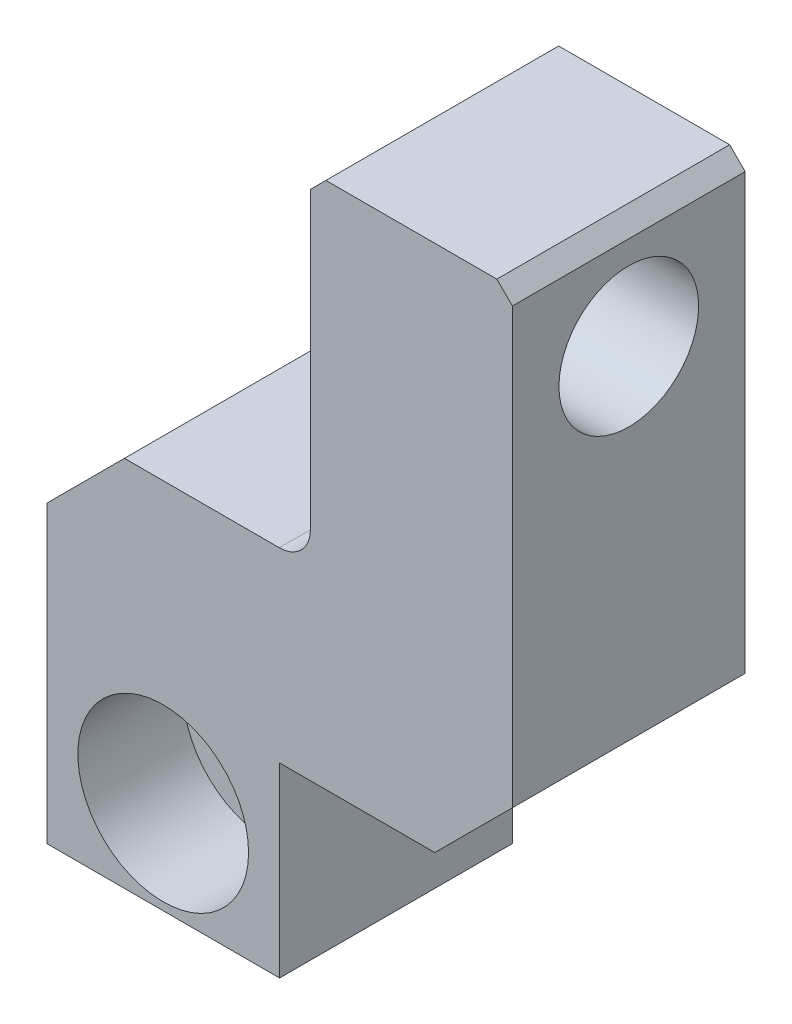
ISO-10303-21;
HEADER;
FILE_DESCRIPTION(('STEP AP214'),'2;1');
FILE_NAME('part.step','',(''),(''),'','','');
FILE_SCHEMA(('AUTOMOTIVE_DESIGN { 1 0 10303 214 1 1 1 1 }'));
ENDSEC;
DATA;
#1=APPLICATION_CONTEXT('core data for automotive mechanical design processes');
#2=APPLICATION_PROTOCOL_DEFINITION('international standard','automotive_design',2000,#1);
#3=PRODUCT_CONTEXT('',#1,'mechanical');
#4=PRODUCT('Part','Part','',(#3));
#5=PRODUCT_RELATED_PRODUCT_CATEGORY('part','',(#4));
#6=PRODUCT_DEFINITION_FORMATION('','',#4);
#7=PRODUCT_DEFINITION_CONTEXT('part definition',#1,'design');
#8=PRODUCT_DEFINITION('design','',#6,#7);
#9=PRODUCT_DEFINITION_SHAPE('','',#8);
#10=(LENGTH_UNIT() NAMED_UNIT(*) SI_UNIT(.MILLI.,.METRE.));
#11=(NAMED_UNIT(*) PLANE_ANGLE_UNIT() SI_UNIT($,.RADIAN.));
#12=(NAMED_UNIT(*) SI_UNIT($,.STERADIAN.) SOLID_ANGLE_UNIT());
#13=UNCERTAINTY_MEASURE_WITH_UNIT(LENGTH_MEASURE(1.E-05),#10,'distance_accuracy_value','');
#14=(GEOMETRIC_REPRESENTATION_CONTEXT(3) GLOBAL_UNCERTAINTY_ASSIGNED_CONTEXT((#13)) GLOBAL_UNIT_ASSIGNED_CONTEXT((#10,
#11,#12)) REPRESENTATION_CONTEXT('',''));
#15=CARTESIAN_POINT('',(0.,0.,0.));
#16=DIRECTION('',(0.,0.,1.));
#17=DIRECTION('',(1.,0.,0.));
#18=AXIS2_PLACEMENT_3D('',#15,#16,#17);
#19=CARTESIAN_POINT('',(153.4992259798,34.,15.));
#20=DIRECTION('',(-1.,0.,0.));
#21=DIRECTION('',(0.,0.,1.));
#22=AXIS2_PLACEMENT_3D('',#19,#20,#21);
#23=PLANE('',#22);
#24=CARTESIAN_POINT('',(153.4992259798,27.,7.5));
#25=DIRECTION('',(-1.,0.,0.));
#26=DIRECTION('',(0.,0.,1.));
#27=AXIS2_PLACEMENT_3D('',#24,#25,#26);
#28=CIRCLE('',#27,4.5);
#29=CARTESIAN_POINT('',(153.4992259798,27.,12.));
#30=VERTEX_POINT('',#29);
#31=EDGE_CURVE('E292',#30,#30,#28,.T.);
#32=ORIENTED_EDGE('',*,*,#31,.T.);
#33=EDGE_LOOP('',(#32));
#34=FACE_BOUND('',#33,.T.);
#35=DIRECTION('',(0.,1.,0.));
#36=VECTOR('',#35,1.);
#37=CARTESIAN_POINT('',(153.4992259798,34.,0.));
#38=LINE('',#37,#36);
#39=CARTESIAN_POINT('',(153.4992259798,5.,0.));
#40=VERTEX_POINT('',#39);
#41=CARTESIAN_POINT('',(153.4992259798,33.,0.));
#42=VERTEX_POINT('',#41);
#43=EDGE_CURVE('E148',#40,#42,#38,.T.);
#44=ORIENTED_EDGE('',*,*,#43,.T.);
#45=DIRECTION('',(0.,0.,1.));
#46=VECTOR('',#45,1.);
#47=CARTESIAN_POINT('',(153.4992259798,33.,15.));
#48=LINE('',#47,#46);
#49=CARTESIAN_POINT('',(153.4992259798,33.,15.));
#50=VERTEX_POINT('',#49);
#51=EDGE_CURVE('E39',#42,#50,#48,.T.);
#52=ORIENTED_EDGE('',*,*,#51,.T.);
#53=DIRECTION('',(0.,1.,0.));
#54=VECTOR('',#53,1.);
#55=CARTESIAN_POINT('',(153.4992259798,34.,15.));
#56=LINE('',#55,#54);
#57=CARTESIAN_POINT('',(153.4992259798,5.,15.));
#58=VERTEX_POINT('',#57);
#59=EDGE_CURVE('E167',#58,#50,#56,.T.);
#60=ORIENTED_EDGE('',*,*,#59,.F.);
#61=DIRECTION('',(0.,0.,-1.));
#62=VECTOR('',#61,1.);
#63=CARTESIAN_POINT('',(153.4992259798,5.,15.));
#64=LINE('',#63,#62);
#65=EDGE_CURVE('E181',#58,#40,#64,.T.);
#66=ORIENTED_EDGE('',*,*,#65,.T.);
#67=EDGE_LOOP('',(#44,#52,#60,#66));
#68=FACE_BOUND('',#67,.T.);
#69=ADVANCED_FACE('F16',(#34,#68),#23,.F.);
#70=CARTESIAN_POINT('',(140.481760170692,34.,15.));
#71=DIRECTION('',(0.,-1.,0.));
#72=DIRECTION('',(0.,0.,-1.));
#73=AXIS2_PLACEMENT_3D('',#70,#71,#72);
#74=PLANE('',#73);
#75=DIRECTION('',(-1.,0.,0.));
#76=VECTOR('',#75,1.);
#77=CARTESIAN_POINT('',(140.481760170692,34.,15.));
#78=LINE('',#77,#76);
#79=CARTESIAN_POINT('',(152.4992259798,34.,15.));
#80=VERTEX_POINT('',#79);
#81=CARTESIAN_POINT('',(141.481760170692,34.,15.));
#82=VERTEX_POINT('',#81);
#83=EDGE_CURVE('E209',#80,#82,#78,.T.);
#84=ORIENTED_EDGE('',*,*,#83,.F.);
#85=DIRECTION('',(0.,0.,-1.));
#86=VECTOR('',#85,1.);
#87=CARTESIAN_POINT('',(152.4992259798,34.,15.));
#88=LINE('',#87,#86);
#89=CARTESIAN_POINT('',(152.4992259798,34.,0.));
#90=VERTEX_POINT('',#89);
#91=EDGE_CURVE('E199',#80,#90,#88,.T.);
#92=ORIENTED_EDGE('',*,*,#91,.T.);
#93=DIRECTION('',(-1.,0.,0.));
#94=VECTOR('',#93,1.);
#95=CARTESIAN_POINT('',(140.481760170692,34.,0.));
#96=LINE('',#95,#94);
#97=CARTESIAN_POINT('',(141.481760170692,34.,0.));
#98=VERTEX_POINT('',#97);
#99=EDGE_CURVE('E150',#90,#98,#96,.T.);
#100=ORIENTED_EDGE('',*,*,#99,.T.);
#101=DIRECTION('',(0.,0.,1.));
#102=VECTOR('',#101,1.);
#103=CARTESIAN_POINT('',(141.481760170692,34.,15.));
#104=LINE('',#103,#102);
#105=EDGE_CURVE('E197',#98,#82,#104,.T.);
#106=ORIENTED_EDGE('',*,*,#105,.T.);
#107=EDGE_LOOP('',(#84,#92,#100,#106));
#108=FACE_BOUND('',#107,.T.);
#109=ADVANCED_FACE('F213',(#108),#74,.F.);
#110=CARTESIAN_POINT('',(140.481760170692,34.,15.));
#111=DIRECTION('',(1.,0.,0.));
#112=DIRECTION('',(0.,0.,-1.));
#113=AXIS2_PLACEMENT_3D('',#110,#111,#112);
#114=PLANE('',#113);
#115=CARTESIAN_POINT('',(140.481760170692,27.,7.5));
#116=DIRECTION('',(-1.,0.,0.));
#117=DIRECTION('',(0.,0.,1.));
#118=AXIS2_PLACEMENT_3D('',#115,#116,#117);
#119=CIRCLE('',#118,4.5);
#120=CARTESIAN_POINT('',(140.481760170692,27.,12.));
#121=VERTEX_POINT('',#120);
#122=EDGE_CURVE('E294',#121,#121,#119,.T.);
#123=ORIENTED_EDGE('',*,*,#122,.F.);
#124=EDGE_LOOP('',(#123));
#125=FACE_BOUND('',#124,.T.);
#126=DIRECTION('',(0.,-1.,0.));
#127=VECTOR('',#126,1.);
#128=CARTESIAN_POINT('',(140.481760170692,34.,15.));
#129=LINE('',#128,#127);
#130=CARTESIAN_POINT('',(140.481760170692,33.,15.));
#131=VERTEX_POINT('',#130);
#132=CARTESIAN_POINT('',(140.481760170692,14.,15.));
#133=VERTEX_POINT('',#132);
#134=EDGE_CURVE('E216',#131,#133,#129,.T.);
#135=ORIENTED_EDGE('',*,*,#134,.F.);
#136=DIRECTION('',(0.,0.,-1.));
#137=VECTOR('',#136,1.);
#138=CARTESIAN_POINT('',(140.481760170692,33.,15.));
#139=LINE('',#138,#137);
#140=CARTESIAN_POINT('',(140.481760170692,33.,0.));
#141=VERTEX_POINT('',#140);
#142=EDGE_CURVE('E11',#131,#141,#139,.T.);
#143=ORIENTED_EDGE('',*,*,#142,.T.);
#144=DIRECTION('',(0.,-1.,0.));
#145=VECTOR('',#144,1.);
#146=CARTESIAN_POINT('',(140.481760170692,34.,0.));
#147=LINE('',#146,#145);
#148=CARTESIAN_POINT('',(140.481760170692,14.,0.));
#149=VERTEX_POINT('',#148);
#150=EDGE_CURVE('E154',#141,#149,#147,.T.);
#151=ORIENTED_EDGE('',*,*,#150,.T.);
#152=DIRECTION('',(0.,0.,-1.));
#153=VECTOR('',#152,1.);
#154=CARTESIAN_POINT('',(140.481760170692,14.,15.));
#155=LINE('',#154,#153);
#156=EDGE_CURVE('E173',#149,#133,#155,.F.);
#157=ORIENTED_EDGE('',*,*,#156,.T.);
#158=EDGE_LOOP('',(#135,#143,#151,#157));
#159=FACE_BOUND('',#158,.T.);
#160=ADVANCED_FACE('F260',(#125,#159),#114,.F.);
#161=CARTESIAN_POINT('',(123.4992259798,12.,15.));
#162=DIRECTION('',(0.,-1.,0.));
#163=DIRECTION('',(0.,0.,-1.));
#164=AXIS2_PLACEMENT_3D('',#161,#162,#163);
#165=PLANE('',#164);
#166=DIRECTION('',(-1.,0.,0.));
#167=VECTOR('',#166,1.);
#168=CARTESIAN_POINT('',(123.4992259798,12.,0.));
#169=LINE('',#168,#167);
#170=CARTESIAN_POINT('',(138.481760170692,12.,0.));
#171=VERTEX_POINT('',#170);
#172=CARTESIAN_POINT('',(128.4992259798,12.,0.));
#173=VERTEX_POINT('',#172);
#174=EDGE_CURVE('E156',#171,#173,#169,.T.);
#175=ORIENTED_EDGE('',*,*,#174,.T.);
#176=DIRECTION('',(0.,0.,1.));
#177=VECTOR('',#176,1.);
#178=CARTESIAN_POINT('',(128.4992259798,12.,15.));
#179=LINE('',#178,#177);
#180=CARTESIAN_POINT('',(128.4992259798,12.,15.));
#181=VERTEX_POINT('',#180);
#182=EDGE_CURVE('E195',#173,#181,#179,.T.);
#183=ORIENTED_EDGE('',*,*,#182,.T.);
#184=DIRECTION('',(-1.,0.,0.));
#185=VECTOR('',#184,1.);
#186=CARTESIAN_POINT('',(123.4992259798,12.,15.));
#187=LINE('',#186,#185);
#188=CARTESIAN_POINT('',(138.481760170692,12.,15.));
#189=VERTEX_POINT('',#188);
#190=EDGE_CURVE('E124',#189,#181,#187,.T.);
#191=ORIENTED_EDGE('',*,*,#190,.F.);
#192=DIRECTION('',(0.,0.,-1.));
#193=VECTOR('',#192,1.);
#194=CARTESIAN_POINT('',(138.481760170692,12.,0.));
#195=LINE('',#194,#193);
#196=EDGE_CURVE('E133',#189,#171,#195,.T.);
#197=ORIENTED_EDGE('',*,*,#196,.T.);
#198=EDGE_LOOP('',(#175,#183,#191,#197));
#199=FACE_BOUND('',#198,.T.);
#200=ADVANCED_FACE('F239',(#199),#165,.F.);
#201=CARTESIAN_POINT('',(123.4992259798,-12.,15.));
#202=DIRECTION('',(1.,0.,0.));
#203=DIRECTION('',(0.,0.,-1.));
#204=AXIS2_PLACEMENT_3D('',#201,#202,#203);
#205=PLANE('',#204);
#206=DIRECTION('',(0.,-1.,0.));
#207=VECTOR('',#206,1.);
#208=CARTESIAN_POINT('',(123.4992259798,-12.,15.));
#209=LINE('',#208,#207);
#210=CARTESIAN_POINT('',(123.4992259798,7.,15.));
#211=VERTEX_POINT('',#210);
#212=CARTESIAN_POINT('',(123.4992259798,-12.,15.));
#213=VERTEX_POINT('',#212);
#214=EDGE_CURVE('E112',#211,#213,#209,.T.);
#215=ORIENTED_EDGE('',*,*,#214,.F.);
#216=DIRECTION('',(0.,0.,-1.));
#217=VECTOR('',#216,1.);
#218=CARTESIAN_POINT('',(123.4992259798,7.,15.));
#219=LINE('',#218,#217);
#220=CARTESIAN_POINT('',(123.4992259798,7.,0.));
#221=VERTEX_POINT('',#220);
#222=EDGE_CURVE('E193',#211,#221,#219,.T.);
#223=ORIENTED_EDGE('',*,*,#222,.T.);
#224=DIRECTION('',(0.,-1.,0.));
#225=VECTOR('',#224,1.);
#226=CARTESIAN_POINT('',(123.4992259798,-12.,0.));
#227=LINE('',#226,#225);
#228=CARTESIAN_POINT('',(123.4992259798,-12.,0.));
#229=VERTEX_POINT('',#228);
#230=EDGE_CURVE('E130',#221,#229,#227,.T.);
#231=ORIENTED_EDGE('',*,*,#230,.T.);
#232=DIRECTION('',(0.,0.,-1.));
#233=VECTOR('',#232,1.);
#234=CARTESIAN_POINT('',(123.4992259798,-12.,15.));
#235=LINE('',#234,#233);
#236=EDGE_CURVE('E127',#213,#229,#235,.T.);
#237=ORIENTED_EDGE('',*,*,#236,.F.);
#238=EDGE_LOOP('',(#215,#223,#231,#237));
#239=FACE_BOUND('',#238,.T.);
#240=ADVANCED_FACE('F128',(#239),#205,.F.);
#241=CARTESIAN_POINT('',(138.4992259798,-12.,15.));
#242=DIRECTION('',(0.,1.,0.));
#243=DIRECTION('',(-1.,0.,0.));
#244=AXIS2_PLACEMENT_3D('',#241,#242,#243);
#245=PLANE('',#244);
#246=DIRECTION('',(1.,0.,0.));
#247=VECTOR('',#246,1.);
#248=CARTESIAN_POINT('',(138.4992259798,-12.,0.));
#249=LINE('',#248,#247);
#250=CARTESIAN_POINT('',(138.4992259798,-12.,0.));
#251=VERTEX_POINT('',#250);
#252=EDGE_CURVE('E160',#229,#251,#249,.T.);
#253=ORIENTED_EDGE('',*,*,#252,.T.);
#254=DIRECTION('',(0.,0.,-1.));
#255=VECTOR('',#254,1.);
#256=CARTESIAN_POINT('',(138.4992259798,-12.,15.));
#257=LINE('',#256,#255);
#258=CARTESIAN_POINT('',(138.4992259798,-12.,15.));
#259=VERTEX_POINT('',#258);
#260=EDGE_CURVE('E134',#259,#251,#257,.T.);
#261=ORIENTED_EDGE('',*,*,#260,.F.);
#262=DIRECTION('',(1.,0.,0.));
#263=VECTOR('',#262,1.);
#264=CARTESIAN_POINT('',(138.4992259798,-12.,15.));
#265=LINE('',#264,#263);
#266=EDGE_CURVE('E116',#213,#259,#265,.T.);
#267=ORIENTED_EDGE('',*,*,#266,.F.);
#268=ORIENTED_EDGE('',*,*,#236,.T.);
#269=EDGE_LOOP('',(#253,#261,#267,#268));
#270=FACE_BOUND('',#269,.T.);
#271=ADVANCED_FACE('F136',(#270),#245,.F.);
#272=CARTESIAN_POINT('',(138.4992259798,-12.,15.));
#273=DIRECTION('',(-1.,0.,0.));
#274=DIRECTION('',(0.,0.,1.));
#275=AXIS2_PLACEMENT_3D('',#272,#273,#274);
#276=PLANE('',#275);
#277=DIRECTION('',(0.,1.,0.));
#278=VECTOR('',#277,1.);
#279=CARTESIAN_POINT('',(138.4992259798,-12.,0.));
#280=LINE('',#279,#278);
#281=CARTESIAN_POINT('',(138.4992259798,0.,0.));
#282=VERTEX_POINT('',#281);
#283=EDGE_CURVE('E162',#251,#282,#280,.T.);
#284=ORIENTED_EDGE('',*,*,#283,.T.);
#285=DIRECTION('',(0.,0.,-1.));
#286=VECTOR('',#285,1.);
#287=CARTESIAN_POINT('',(138.4992259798,0.,15.));
#288=LINE('',#287,#286);
#289=CARTESIAN_POINT('',(138.4992259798,0.,15.));
#290=VERTEX_POINT('',#289);
#291=EDGE_CURVE('E147',#290,#282,#288,.T.);
#292=ORIENTED_EDGE('',*,*,#291,.F.);
#293=DIRECTION('',(0.,1.,0.));
#294=VECTOR('',#293,1.);
#295=CARTESIAN_POINT('',(138.4992259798,-12.,15.));
#296=LINE('',#295,#294);
#297=EDGE_CURVE('E139',#259,#290,#296,.T.);
#298=ORIENTED_EDGE('',*,*,#297,.F.);
#299=ORIENTED_EDGE('',*,*,#260,.T.);
#300=EDGE_LOOP('',(#284,#292,#298,#299));
#301=FACE_BOUND('',#300,.T.);
#302=ADVANCED_FACE('F234',(#301),#276,.F.);
#303=CARTESIAN_POINT('',(138.4992259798,0.,15.));
#304=DIRECTION('',(0.,1.,0.));
#305=DIRECTION('',(0.,0.,1.));
#306=AXIS2_PLACEMENT_3D('',#303,#304,#305);
#307=PLANE('',#306);
#308=DIRECTION('',(1.,0.,0.));
#309=VECTOR('',#308,1.);
#310=CARTESIAN_POINT('',(138.4992259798,0.,0.));
#311=LINE('',#310,#309);
#312=CARTESIAN_POINT('',(148.4992259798,0.,0.));
#313=VERTEX_POINT('',#312);
#314=EDGE_CURVE('E164',#282,#313,#311,.T.);
#315=ORIENTED_EDGE('',*,*,#314,.T.);
#316=DIRECTION('',(0.,0.,1.));
#317=VECTOR('',#316,1.);
#318=CARTESIAN_POINT('',(148.4992259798,0.,15.));
#319=LINE('',#318,#317);
#320=CARTESIAN_POINT('',(148.4992259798,0.,15.));
#321=VERTEX_POINT('',#320);
#322=EDGE_CURVE('E188',#313,#321,#319,.T.);
#323=ORIENTED_EDGE('',*,*,#322,.T.);
#324=DIRECTION('',(1.,0.,0.));
#325=VECTOR('',#324,1.);
#326=CARTESIAN_POINT('',(138.4992259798,0.,15.));
#327=LINE('',#326,#325);
#328=EDGE_CURVE('E141',#290,#321,#327,.T.);
#329=ORIENTED_EDGE('',*,*,#328,.F.);
#330=ORIENTED_EDGE('',*,*,#291,.T.);
#331=EDGE_LOOP('',(#315,#323,#329,#330));
#332=FACE_BOUND('',#331,.T.);
#333=ADVANCED_FACE('F230',(#332),#307,.F.);
#334=CARTESIAN_POINT('',(0.,0.,15.));
#335=DIRECTION('',(0.,0.,1.));
#336=DIRECTION('',(1.,0.,0.));
#337=AXIS2_PLACEMENT_3D('',#334,#335,#336);
#338=PLANE('',#337);
#339=CARTESIAN_POINT('',(130.9992259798,-6.,15.));
#340=DIRECTION('',(0.,0.,1.));
#341=DIRECTION('',(1.,0.,0.));
#342=AXIS2_PLACEMENT_3D('',#339,#340,#341);
#343=CIRCLE('',#342,5.5);
#344=CARTESIAN_POINT('',(136.4992259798,-6.,15.));
#345=VERTEX_POINT('',#344);
#346=EDGE_CURVE('E289',#345,#345,#343,.T.);
#347=ORIENTED_EDGE('',*,*,#346,.F.);
#348=EDGE_LOOP('',(#347));
#349=FACE_BOUND('',#348,.T.);
#350=ORIENTED_EDGE('',*,*,#59,.T.);
#351=DIRECTION('',(0.707106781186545,-0.70710678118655,0.));
#352=VECTOR('',#351,1.);
#353=CARTESIAN_POINT('',(93.2496129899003,93.2496129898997,15.));
#354=LINE('',#353,#352);
#355=EDGE_CURVE('E24',#50,#80,#354,.F.);
#356=ORIENTED_EDGE('',*,*,#355,.T.);
#357=ORIENTED_EDGE('',*,*,#83,.T.);
#358=DIRECTION('',(0.707106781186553,0.707106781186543,0.));
#359=VECTOR('',#358,1.);
#360=CARTESIAN_POINT('',(53.7408800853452,-53.7408800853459,15.));
#361=LINE('',#360,#359);
#362=EDGE_CURVE('E31',#82,#131,#361,.F.);
#363=ORIENTED_EDGE('',*,*,#362,.T.);
#364=ORIENTED_EDGE('',*,*,#134,.T.);
#365=CARTESIAN_POINT('',(138.481760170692,14.,15.));
#366=DIRECTION('',(0.,0.,1.));
#367=DIRECTION('',(1.,0.,0.));
#368=AXIS2_PLACEMENT_3D('',#365,#366,#367);
#369=CIRCLE('',#368,2.);
#370=EDGE_CURVE('E179',#133,#189,#369,.F.);
#371=ORIENTED_EDGE('',*,*,#370,.T.);
#372=ORIENTED_EDGE('',*,*,#190,.T.);
#373=DIRECTION('',(0.707106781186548,0.707106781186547,0.));
#374=VECTOR('',#373,1.);
#375=CARTESIAN_POINT('',(58.2496129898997,-58.2496129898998,15.));
#376=LINE('',#375,#374);
#377=EDGE_CURVE('E120',#181,#211,#376,.F.);
#378=ORIENTED_EDGE('',*,*,#377,.T.);
#379=ORIENTED_EDGE('',*,*,#214,.T.);
#380=ORIENTED_EDGE('',*,*,#266,.T.);
#381=ORIENTED_EDGE('',*,*,#297,.T.);
#382=ORIENTED_EDGE('',*,*,#328,.T.);
#383=DIRECTION('',(-0.707106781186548,-0.707106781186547,0.));
#384=VECTOR('',#383,1.);
#385=CARTESIAN_POINT('',(74.2496129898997,-74.2496129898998,15.));
#386=LINE('',#385,#384);
#387=EDGE_CURVE('E191',#321,#58,#386,.F.);
#388=ORIENTED_EDGE('',*,*,#387,.T.);
#389=EDGE_LOOP('',(#350,#356,#357,#363,#364,#371,#372,#378,#379,#380,#381,#382,#388));
#390=FACE_BOUND('',#389,.T.);
#391=ADVANCED_FACE('F114',(#349,#390),#338,.T.);
#392=CARTESIAN_POINT('',(0.,0.,0.));
#393=DIRECTION('',(0.,0.,1.));
#394=DIRECTION('',(1.,0.,0.));
#395=AXIS2_PLACEMENT_3D('',#392,#393,#394);
#396=PLANE('',#395);
#397=CARTESIAN_POINT('',(130.9992259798,-6.,0.));
#398=DIRECTION('',(0.,0.,1.));
#399=DIRECTION('',(1.,0.,0.));
#400=AXIS2_PLACEMENT_3D('',#397,#398,#399);
#401=CIRCLE('',#400,3.3);
#402=CARTESIAN_POINT('',(134.2992259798,-6.,0.));
#403=VERTEX_POINT('',#402);
#404=EDGE_CURVE('E151',#403,#403,#401,.T.);
#405=ORIENTED_EDGE('',*,*,#404,.T.);
#406=EDGE_LOOP('',(#405));
#407=FACE_BOUND('',#406,.T.);
#408=ORIENTED_EDGE('',*,*,#99,.F.);
#409=DIRECTION('',(-0.707106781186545,0.70710678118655,0.));
#410=VECTOR('',#409,1.);
#411=CARTESIAN_POINT('',(152.4992259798,34.,0.));
#412=LINE('',#411,#410);
#413=EDGE_CURVE('E204',#90,#42,#412,.F.);
#414=ORIENTED_EDGE('',*,*,#413,.T.);
#415=ORIENTED_EDGE('',*,*,#43,.F.);
#416=DIRECTION('',(0.707106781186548,0.707106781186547,0.));
#417=VECTOR('',#416,1.);
#418=CARTESIAN_POINT('',(153.4992259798,5.,0.));
#419=LINE('',#418,#417);
#420=EDGE_CURVE('E186',#40,#313,#419,.F.);
#421=ORIENTED_EDGE('',*,*,#420,.T.);
#422=ORIENTED_EDGE('',*,*,#314,.F.);
#423=ORIENTED_EDGE('',*,*,#283,.F.);
#424=ORIENTED_EDGE('',*,*,#252,.F.);
#425=ORIENTED_EDGE('',*,*,#230,.F.);
#426=DIRECTION('',(-0.707106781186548,-0.707106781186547,0.));
#427=VECTOR('',#426,1.);
#428=CARTESIAN_POINT('',(123.4992259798,7.,0.));
#429=LINE('',#428,#427);
#430=EDGE_CURVE('E184',#221,#173,#429,.F.);
#431=ORIENTED_EDGE('',*,*,#430,.T.);
#432=ORIENTED_EDGE('',*,*,#174,.F.);
#433=CARTESIAN_POINT('',(138.481760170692,14.,0.));
#434=DIRECTION('',(0.,0.,1.));
#435=DIRECTION('',(1.,0.,0.));
#436=AXIS2_PLACEMENT_3D('',#433,#434,#435);
#437=CIRCLE('',#436,2.);
#438=EDGE_CURVE('E176',#171,#149,#437,.T.);
#439=ORIENTED_EDGE('',*,*,#438,.T.);
#440=ORIENTED_EDGE('',*,*,#150,.F.);
#441=DIRECTION('',(-0.707106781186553,-0.707106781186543,0.));
#442=VECTOR('',#441,1.);
#443=CARTESIAN_POINT('',(140.481760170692,33.,0.));
#444=LINE('',#443,#442);
#445=EDGE_CURVE('E202',#141,#98,#444,.F.);
#446=ORIENTED_EDGE('',*,*,#445,.T.);
#447=EDGE_LOOP('',(#408,#414,#415,#421,#422,#423,#424,#425,#431,#432,#439,#440,#446));
#448=FACE_BOUND('',#447,.T.);
#449=ADVANCED_FACE('F221',(#407,#448),#396,.F.);
#450=CARTESIAN_POINT('',(130.9992259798,-6.,15.));
#451=DIRECTION('',(0.,0.,1.));
#452=DIRECTION('',(1.,0.,0.));
#453=AXIS2_PLACEMENT_3D('',#450,#451,#452);
#454=CYLINDRICAL_SURFACE('',#453,3.3);
#455=ORIENTED_EDGE('',*,*,#404,.F.);
#456=EDGE_LOOP('',(#455));
#457=FACE_BOUND('',#456,.T.);
#458=CARTESIAN_POINT('',(130.9992259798,-6.,8.2));
#459=DIRECTION('',(0.,0.,1.));
#460=DIRECTION('',(1.,0.,0.));
#461=AXIS2_PLACEMENT_3D('',#458,#459,#460);
#462=CIRCLE('',#461,3.3);
#463=CARTESIAN_POINT('',(134.2992259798,-6.,8.2));
#464=VERTEX_POINT('',#463);
#465=EDGE_CURVE('E283',#464,#464,#462,.T.);
#466=ORIENTED_EDGE('',*,*,#465,.T.);
#467=EDGE_LOOP('',(#466));
#468=FACE_BOUND('',#467,.T.);
#469=ADVANCED_FACE('F358',(#457,#468),#454,.F.);
#470=CARTESIAN_POINT('',(134.2992259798,-6.,8.2));
#471=DIRECTION('',(0.,0.,-1.));
#472=DIRECTION('',(-1.,0.,0.));
#473=AXIS2_PLACEMENT_3D('',#470,#471,#472);
#474=PLANE('',#473);
#475=ORIENTED_EDGE('',*,*,#465,.F.);
#476=EDGE_LOOP('',(#475));
#477=FACE_BOUND('',#476,.T.);
#478=CARTESIAN_POINT('',(130.9992259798,-6.,8.2));
#479=DIRECTION('',(0.,0.,1.));
#480=DIRECTION('',(1.,0.,0.));
#481=AXIS2_PLACEMENT_3D('',#478,#479,#480);
#482=CIRCLE('',#481,5.5);
#483=CARTESIAN_POINT('',(136.4992259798,-6.,8.2));
#484=VERTEX_POINT('',#483);
#485=EDGE_CURVE('E286',#484,#484,#482,.T.);
#486=ORIENTED_EDGE('',*,*,#485,.T.);
#487=EDGE_LOOP('',(#486));
#488=FACE_BOUND('',#487,.T.);
#489=ADVANCED_FACE('F347',(#477,#488),#474,.F.);
#490=CARTESIAN_POINT('',(130.9992259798,-6.,15.));
#491=DIRECTION('',(0.,0.,1.));
#492=DIRECTION('',(1.,0.,0.));
#493=AXIS2_PLACEMENT_3D('',#490,#491,#492);
#494=CYLINDRICAL_SURFACE('',#493,5.5);
#495=ORIENTED_EDGE('',*,*,#485,.F.);
#496=EDGE_LOOP('',(#495));
#497=FACE_BOUND('',#496,.T.);
#498=ORIENTED_EDGE('',*,*,#346,.T.);
#499=EDGE_LOOP('',(#498));
#500=FACE_BOUND('',#499,.T.);
#501=ADVANCED_FACE('F273',(#497,#500),#494,.F.);
#502=CARTESIAN_POINT('',(140.481760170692,27.,7.5));
#503=DIRECTION('',(-1.,0.,0.));
#504=DIRECTION('',(0.,0.,1.));
#505=AXIS2_PLACEMENT_3D('',#502,#503,#504);
#506=CYLINDRICAL_SURFACE('',#505,4.5);
#507=ORIENTED_EDGE('',*,*,#31,.F.);
#508=EDGE_LOOP('',(#507));
#509=FACE_BOUND('',#508,.T.);
#510=ORIENTED_EDGE('',*,*,#122,.T.);
#511=EDGE_LOOP('',(#510));
#512=FACE_BOUND('',#511,.T.);
#513=ADVANCED_FACE('F266',(#509,#512),#506,.F.);
#514=CARTESIAN_POINT('',(138.481760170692,14.,15.));
#515=DIRECTION('',(0.,0.,1.));
#516=DIRECTION('',(1.,0.,0.));
#517=AXIS2_PLACEMENT_3D('',#514,#515,#516);
#518=CYLINDRICAL_SURFACE('',#517,2.);
#519=ORIENTED_EDGE('',*,*,#370,.F.);
#520=ORIENTED_EDGE('',*,*,#156,.F.);
#521=ORIENTED_EDGE('',*,*,#438,.F.);
#522=ORIENTED_EDGE('',*,*,#196,.F.);
#523=EDGE_LOOP('',(#519,#520,#521,#522));
#524=FACE_BOUND('',#523,.T.);
#525=ADVANCED_FACE('F251',(#524),#518,.F.);
#526=CARTESIAN_POINT('',(153.4992259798,5.,15.));
#527=DIRECTION('',(-0.707106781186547,0.707106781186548,0.));
#528=DIRECTION('',(0.,0.,-1.));
#529=AXIS2_PLACEMENT_3D('',#526,#527,#528);
#530=PLANE('',#529);
#531=ORIENTED_EDGE('',*,*,#387,.F.);
#532=ORIENTED_EDGE('',*,*,#322,.F.);
#533=ORIENTED_EDGE('',*,*,#420,.F.);
#534=ORIENTED_EDGE('',*,*,#65,.F.);
#535=EDGE_LOOP('',(#531,#532,#533,#534));
#536=FACE_BOUND('',#535,.T.);
#537=ADVANCED_FACE('F225',(#536),#530,.F.);
#538=CARTESIAN_POINT('',(123.4992259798,7.,15.));
#539=DIRECTION('',(0.707106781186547,-0.707106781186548,0.));
#540=DIRECTION('',(0.,0.,-1.));
#541=AXIS2_PLACEMENT_3D('',#538,#539,#540);
#542=PLANE('',#541);
#543=ORIENTED_EDGE('',*,*,#377,.F.);
#544=ORIENTED_EDGE('',*,*,#182,.F.);
#545=ORIENTED_EDGE('',*,*,#430,.F.);
#546=ORIENTED_EDGE('',*,*,#222,.F.);
#547=EDGE_LOOP('',(#543,#544,#545,#546));
#548=FACE_BOUND('',#547,.T.);
#549=ADVANCED_FACE('F242',(#548),#542,.F.);
#550=CARTESIAN_POINT('',(152.4992259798,34.,15.));
#551=DIRECTION('',(-0.70710678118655,-0.707106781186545,0.));
#552=DIRECTION('',(0.,0.,-1.));
#553=AXIS2_PLACEMENT_3D('',#550,#551,#552);
#554=PLANE('',#553);
#555=ORIENTED_EDGE('',*,*,#355,.F.);
#556=ORIENTED_EDGE('',*,*,#51,.F.);
#557=ORIENTED_EDGE('',*,*,#413,.F.);
#558=ORIENTED_EDGE('',*,*,#91,.F.);
#559=EDGE_LOOP('',(#555,#556,#557,#558));
#560=FACE_BOUND('',#559,.T.);
#561=ADVANCED_FACE('F218',(#560),#554,.F.);
#562=CARTESIAN_POINT('',(140.481760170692,33.,15.));
#563=DIRECTION('',(0.707106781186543,-0.707106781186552,0.));
#564=DIRECTION('',(0.,0.,-1.));
#565=AXIS2_PLACEMENT_3D('',#562,#563,#564);
#566=PLANE('',#565);
#567=ORIENTED_EDGE('',*,*,#362,.F.);
#568=ORIENTED_EDGE('',*,*,#105,.F.);
#569=ORIENTED_EDGE('',*,*,#445,.F.);
#570=ORIENTED_EDGE('',*,*,#142,.F.);
#571=EDGE_LOOP('',(#567,#568,#569,#570));
#572=FACE_BOUND('',#571,.T.);
#573=ADVANCED_FACE('F18',(#572),#566,.F.);
#574=CLOSED_SHELL('',(#69,#109,#160,#200,#240,#271,#302,#333,#391,#449,#469,#489,#501,#513,#525,
#537,#549,#561,#573));
#575=MANIFOLD_SOLID_BREP('B1',#574);
#576=ADVANCED_BREP_SHAPE_REPRESENTATION('',(#18,#575),#14);
#577=SHAPE_DEFINITION_REPRESENTATION(#9,#576);
ENDSEC;
END-ISO-10303-21;
